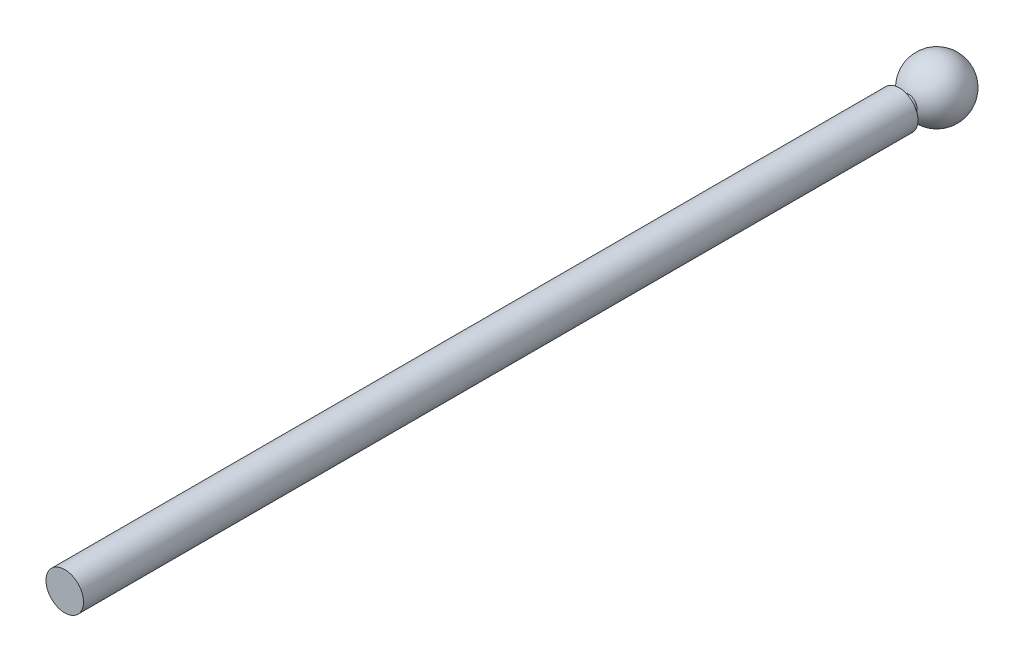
from build123d import *

# Parameters (mm, degrees)
SKETCH_2_R      = 10
EXTRUDE_1_DEPTH = 45
SKETCH_3_R      = 22.5
EXTRUDE_2_DEPTH = 1000


with BuildPart() as part:
    # Sketch 1 → Revolve 1 (revolve)
    with BuildSketch(Plane.XY):
        with BuildLine():
            Line((0, 35), (0, -35))
            ThreePointArc((0, -35), (35, 0), (0, 35))
        make_face()
    revolve(axis=Axis((0, 75.987150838, 0), (0, -1, 0)))

    # Sketch 2 → Extrude 1 (add)
    with BuildSketch(Plane.XY):
        with Locations(Location((0, 0, 0), (0, 0, 180))):
            Circle(SKETCH_2_R)
    extrude(amount=EXTRUDE_1_DEPTH)

    # Sketch 3 → Extrude 2 (add)
    with BuildSketch(Plane.XY.offset(45)):
        Circle(SKETCH_3_R)
    extrude(amount=EXTRUDE_2_DEPTH)


solid = part.part
